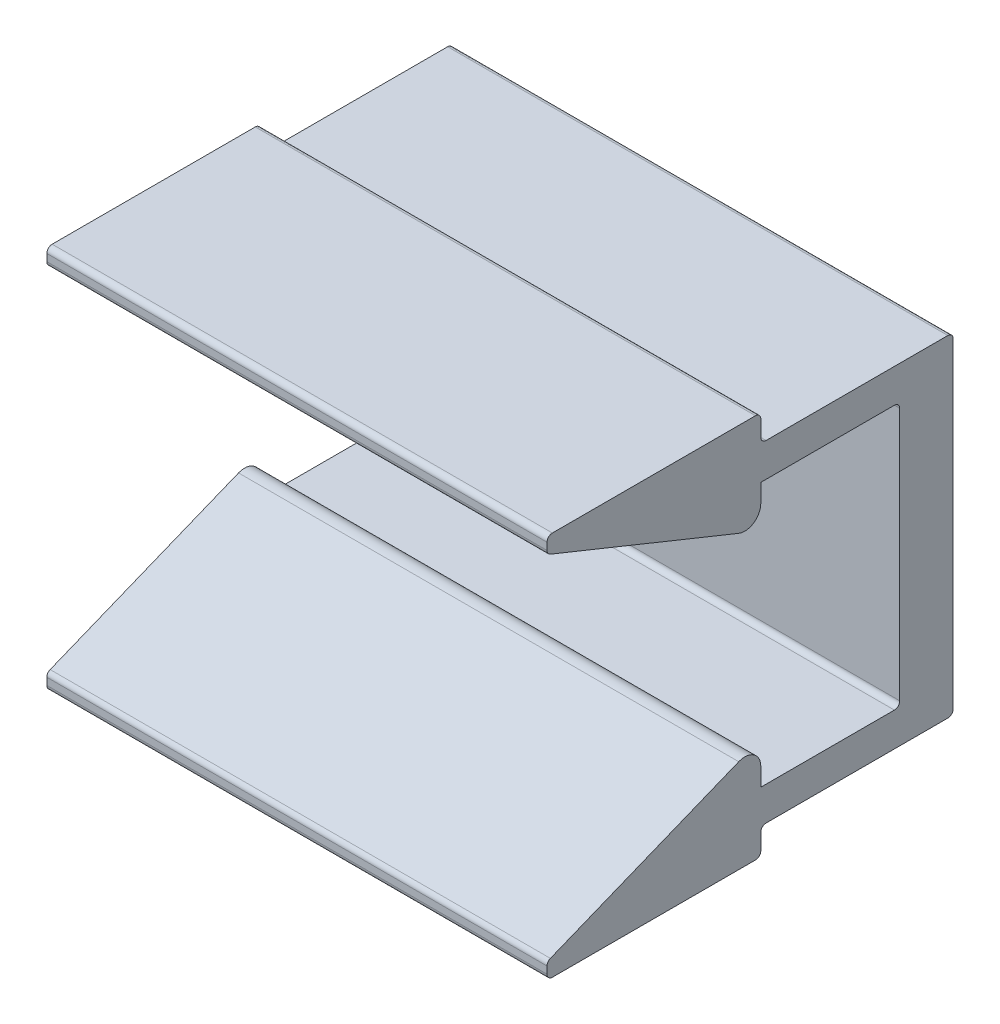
ISO-10303-21;
HEADER;
FILE_DESCRIPTION(('STEP AP214'),'2;1');
FILE_NAME('part.step','',(''),(''),'','','');
FILE_SCHEMA(('AUTOMOTIVE_DESIGN { 1 0 10303 214 1 1 1 1 }'));
ENDSEC;
DATA;
#1=APPLICATION_CONTEXT('core data for automotive mechanical design processes');
#2=APPLICATION_PROTOCOL_DEFINITION('international standard','automotive_design',2000,#1);
#3=PRODUCT_CONTEXT('',#1,'mechanical');
#4=PRODUCT('Part','Part','',(#3));
#5=PRODUCT_RELATED_PRODUCT_CATEGORY('part','',(#4));
#6=PRODUCT_DEFINITION_FORMATION('','',#4);
#7=PRODUCT_DEFINITION_CONTEXT('part definition',#1,'design');
#8=PRODUCT_DEFINITION('design','',#6,#7);
#9=PRODUCT_DEFINITION_SHAPE('','',#8);
#10=(LENGTH_UNIT() NAMED_UNIT(*) SI_UNIT(.MILLI.,.METRE.));
#11=(NAMED_UNIT(*) PLANE_ANGLE_UNIT() SI_UNIT($,.RADIAN.));
#12=(NAMED_UNIT(*) SI_UNIT($,.STERADIAN.) SOLID_ANGLE_UNIT());
#13=UNCERTAINTY_MEASURE_WITH_UNIT(LENGTH_MEASURE(1.E-05),#10,'distance_accuracy_value','');
#14=(GEOMETRIC_REPRESENTATION_CONTEXT(3) GLOBAL_UNCERTAINTY_ASSIGNED_CONTEXT((#13)) GLOBAL_UNIT_ASSIGNED_CONTEXT((#10,
#11,#12)) REPRESENTATION_CONTEXT('',''));
#15=CARTESIAN_POINT('',(0.,0.,0.));
#16=DIRECTION('',(0.,0.,1.));
#17=DIRECTION('',(1.,0.,0.));
#18=AXIS2_PLACEMENT_3D('',#15,#16,#17);
#19=CARTESIAN_POINT('',(5.9436,3.0099,1.27));
#20=DIRECTION('',(0.,0.,-1.));
#21=DIRECTION('',(-1.,0.,0.));
#22=AXIS2_PLACEMENT_3D('',#19,#20,#21);
#23=PLANE('',#22);
#24=DIRECTION('',(0.,-1.,0.));
#25=VECTOR('',#24,1.);
#26=CARTESIAN_POINT('',(-5.9436,3.0099,1.27));
#27=LINE('',#26,#25);
#28=CARTESIAN_POINT('',(-5.9436,3.0099,1.27));
#29=VERTEX_POINT('',#28);
#30=CARTESIAN_POINT('',(-5.9436,-3.0099,1.27));
#31=VERTEX_POINT('',#30);
#32=EDGE_CURVE('E218',#29,#31,#27,.T.);
#33=ORIENTED_EDGE('',*,*,#32,.T.);
#34=DIRECTION('',(-1.,0.,0.));
#35=VECTOR('',#34,1.);
#36=CARTESIAN_POINT('',(5.9436,-3.0099,1.27));
#37=LINE('',#36,#35);
#38=CARTESIAN_POINT('',(5.9436,-3.0099,1.27));
#39=VERTEX_POINT('',#38);
#40=EDGE_CURVE('E426',#39,#31,#37,.T.);
#41=ORIENTED_EDGE('',*,*,#40,.F.);
#42=DIRECTION('',(0.,-1.,0.));
#43=VECTOR('',#42,1.);
#44=CARTESIAN_POINT('',(5.9436,3.0099,1.27));
#45=LINE('',#44,#43);
#46=CARTESIAN_POINT('',(5.9436,3.0099,1.27));
#47=VERTEX_POINT('',#46);
#48=EDGE_CURVE('E293',#47,#39,#45,.T.);
#49=ORIENTED_EDGE('',*,*,#48,.F.);
#50=DIRECTION('',(-1.,0.,0.));
#51=VECTOR('',#50,1.);
#52=CARTESIAN_POINT('',(5.9436,3.0099,1.27));
#53=LINE('',#52,#51);
#54=EDGE_CURVE('E23',#47,#29,#53,.T.);
#55=ORIENTED_EDGE('',*,*,#54,.T.);
#56=EDGE_LOOP('',(#33,#41,#49,#55));
#57=FACE_BOUND('',#56,.T.);
#58=CARTESIAN_POINT('',(0.,0.,1.27));
#59=DIRECTION('',(0.,0.,-1.));
#60=DIRECTION('',(-1.,0.,0.));
#61=AXIS2_PLACEMENT_3D('',#58,#59,#60);
#62=CIRCLE('',#61,1.5875);
#63=CARTESIAN_POINT('',(-1.5875,0.,1.27));
#64=VERTEX_POINT('',#63);
#65=EDGE_CURVE('E230',#64,#64,#62,.F.);
#66=ORIENTED_EDGE('',*,*,#65,.F.);
#67=EDGE_LOOP('',(#66));
#68=FACE_BOUND('',#67,.T.);
#69=ADVANCED_FACE('F14',(#57,#68),#23,.F.);
#70=CARTESIAN_POINT('',(5.9436,-3.81,0.));
#71=DIRECTION('',(0.,0.,1.));
#72=DIRECTION('',(1.,0.,0.));
#73=AXIS2_PLACEMENT_3D('',#70,#71,#72);
#74=PLANE('',#73);
#75=DIRECTION('',(0.,1.,0.));
#76=VECTOR('',#75,1.);
#77=CARTESIAN_POINT('',(-5.9436,-3.81,0.));
#78=LINE('',#77,#76);
#79=CARTESIAN_POINT('',(-5.9436,-3.81,0.));
#80=VERTEX_POINT('',#79);
#81=CARTESIAN_POINT('',(-5.9436,3.81,0.));
#82=VERTEX_POINT('',#81);
#83=EDGE_CURVE('E264',#80,#82,#78,.T.);
#84=ORIENTED_EDGE('',*,*,#83,.T.);
#85=DIRECTION('',(-1.,0.,0.));
#86=VECTOR('',#85,1.);
#87=CARTESIAN_POINT('',(5.9436,3.81,0.));
#88=LINE('',#87,#86);
#89=CARTESIAN_POINT('',(5.9436,3.81,0.));
#90=VERTEX_POINT('',#89);
#91=EDGE_CURVE('E381',#90,#82,#88,.T.);
#92=ORIENTED_EDGE('',*,*,#91,.F.);
#93=DIRECTION('',(0.,1.,0.));
#94=VECTOR('',#93,1.);
#95=CARTESIAN_POINT('',(5.9436,-3.81,0.));
#96=LINE('',#95,#94);
#97=CARTESIAN_POINT('',(5.9436,-3.81,0.));
#98=VERTEX_POINT('',#97);
#99=EDGE_CURVE('E323',#98,#90,#96,.T.);
#100=ORIENTED_EDGE('',*,*,#99,.F.);
#101=DIRECTION('',(-1.,0.,0.));
#102=VECTOR('',#101,1.);
#103=CARTESIAN_POINT('',(5.9436,-3.81,0.));
#104=LINE('',#103,#102);
#105=EDGE_CURVE('E384',#98,#80,#104,.T.);
#106=ORIENTED_EDGE('',*,*,#105,.T.);
#107=EDGE_LOOP('',(#84,#92,#100,#106));
#108=FACE_BOUND('',#107,.T.);
#109=CARTESIAN_POINT('',(0.,0.,0.));
#110=DIRECTION('',(0.,0.,1.));
#111=DIRECTION('',(1.,0.,0.));
#112=AXIS2_PLACEMENT_3D('',#109,#110,#111);
#113=CIRCLE('',#112,1.5875);
#114=CARTESIAN_POINT('',(1.5875,0.,0.));
#115=VERTEX_POINT('',#114);
#116=EDGE_CURVE('E18',#115,#115,#113,.F.);
#117=ORIENTED_EDGE('',*,*,#116,.F.);
#118=EDGE_LOOP('',(#117));
#119=FACE_BOUND('',#118,.T.);
#120=ADVANCED_FACE('F507',(#108,#119),#74,.F.);
#121=CARTESIAN_POINT('',(5.9436,3.1369,4.572));
#122=DIRECTION('',(0.,1.,0.));
#123=DIRECTION('',(0.,0.,1.));
#124=AXIS2_PLACEMENT_3D('',#121,#122,#123);
#125=PLANE('',#124);
#126=DIRECTION('',(0.,0.,-1.));
#127=VECTOR('',#126,1.);
#128=CARTESIAN_POINT('',(-5.9436,3.1369,4.572));
#129=LINE('',#128,#127);
#130=CARTESIAN_POINT('',(-5.9436,3.1369,4.572));
#131=VERTEX_POINT('',#130);
#132=CARTESIAN_POINT('',(-5.9436,3.1369,1.397));
#133=VERTEX_POINT('',#132);
#134=EDGE_CURVE('E216',#131,#133,#129,.T.);
#135=ORIENTED_EDGE('',*,*,#134,.T.);
#136=DIRECTION('',(-1.,0.,0.));
#137=VECTOR('',#136,1.);
#138=CARTESIAN_POINT('',(5.9436,3.1369,1.397));
#139=LINE('',#138,#137);
#140=CARTESIAN_POINT('',(5.9436,3.1369,1.397));
#141=VERTEX_POINT('',#140);
#142=EDGE_CURVE('E9',#141,#133,#139,.T.);
#143=ORIENTED_EDGE('',*,*,#142,.F.);
#144=DIRECTION('',(0.,0.,-1.));
#145=VECTOR('',#144,1.);
#146=CARTESIAN_POINT('',(5.9436,3.1369,4.572));
#147=LINE('',#146,#145);
#148=CARTESIAN_POINT('',(5.9436,3.1369,4.572));
#149=VERTEX_POINT('',#148);
#150=EDGE_CURVE('E290',#149,#141,#147,.T.);
#151=ORIENTED_EDGE('',*,*,#150,.F.);
#152=DIRECTION('',(-1.,0.,0.));
#153=VECTOR('',#152,1.);
#154=CARTESIAN_POINT('',(5.9436,3.1369,4.572));
#155=LINE('',#154,#153);
#156=EDGE_CURVE('E229',#149,#131,#155,.T.);
#157=ORIENTED_EDGE('',*,*,#156,.T.);
#158=EDGE_LOOP('',(#135,#143,#151,#157));
#159=FACE_BOUND('',#158,.T.);
#160=ADVANCED_FACE('F16',(#159),#125,.F.);
#161=CARTESIAN_POINT('',(5.9436,3.0099,1.397));
#162=DIRECTION('',(-1.,0.,0.));
#163=DIRECTION('',(0.,-1.,0.));
#164=AXIS2_PLACEMENT_3D('',#161,#162,#163);
#165=CYLINDRICAL_SURFACE('',#164,0.127);
#166=CARTESIAN_POINT('',(-5.9436,3.0099,1.397));
#167=DIRECTION('',(-1.,0.,0.));
#168=DIRECTION('',(0.,-1.,0.));
#169=AXIS2_PLACEMENT_3D('',#166,#167,#168);
#170=CIRCLE('',#169,0.127);
#171=EDGE_CURVE('E212',#133,#29,#170,.T.);
#172=ORIENTED_EDGE('',*,*,#171,.T.);
#173=ORIENTED_EDGE('',*,*,#54,.F.);
#174=CARTESIAN_POINT('',(5.9436,3.0099,1.397));
#175=DIRECTION('',(-1.,0.,0.));
#176=DIRECTION('',(0.,-1.,0.));
#177=AXIS2_PLACEMENT_3D('',#174,#175,#176);
#178=CIRCLE('',#177,0.127);
#179=EDGE_CURVE('E225',#141,#47,#178,.T.);
#180=ORIENTED_EDGE('',*,*,#179,.F.);
#181=ORIENTED_EDGE('',*,*,#142,.T.);
#182=EDGE_LOOP('',(#172,#173,#180,#181));
#183=FACE_BOUND('',#182,.T.);
#184=ADVANCED_FACE('F224',(#183),#165,.F.);
#185=CARTESIAN_POINT('',(5.9436,-3.0099,1.397));
#186=DIRECTION('',(-1.,0.,0.));
#187=DIRECTION('',(0.,-1.,0.));
#188=AXIS2_PLACEMENT_3D('',#185,#186,#187);
#189=CYLINDRICAL_SURFACE('',#188,0.127);
#190=CARTESIAN_POINT('',(-5.9436,-3.0099,1.397));
#191=DIRECTION('',(-1.,0.,0.));
#192=DIRECTION('',(0.,1.,0.));
#193=AXIS2_PLACEMENT_3D('',#190,#191,#192);
#194=CIRCLE('',#193,0.127);
#195=CARTESIAN_POINT('',(-5.9436,-3.1369,1.397));
#196=VERTEX_POINT('',#195);
#197=EDGE_CURVE('E236',#31,#196,#194,.T.);
#198=ORIENTED_EDGE('',*,*,#197,.T.);
#199=DIRECTION('',(-1.,0.,0.));
#200=VECTOR('',#199,1.);
#201=CARTESIAN_POINT('',(5.9436,-3.1369,1.397));
#202=LINE('',#201,#200);
#203=CARTESIAN_POINT('',(5.9436,-3.1369,1.397));
#204=VERTEX_POINT('',#203);
#205=EDGE_CURVE('E423',#204,#196,#202,.T.);
#206=ORIENTED_EDGE('',*,*,#205,.F.);
#207=CARTESIAN_POINT('',(5.9436,-3.0099,1.397));
#208=DIRECTION('',(-1.,0.,0.));
#209=DIRECTION('',(0.,1.,0.));
#210=AXIS2_PLACEMENT_3D('',#207,#208,#209);
#211=CIRCLE('',#210,0.127);
#212=EDGE_CURVE('E295',#39,#204,#211,.T.);
#213=ORIENTED_EDGE('',*,*,#212,.F.);
#214=ORIENTED_EDGE('',*,*,#40,.T.);
#215=EDGE_LOOP('',(#198,#206,#213,#214));
#216=FACE_BOUND('',#215,.T.);
#217=ADVANCED_FACE('F439',(#216),#189,.F.);
#218=CARTESIAN_POINT('',(5.9436,-3.1369,4.572));
#219=DIRECTION('',(0.,-1.,0.));
#220=DIRECTION('',(0.,0.,-1.));
#221=AXIS2_PLACEMENT_3D('',#218,#219,#220);
#222=PLANE('',#221);
#223=DIRECTION('',(0.,0.,1.));
#224=VECTOR('',#223,1.);
#225=CARTESIAN_POINT('',(-5.9436,-3.1369,4.572));
#226=LINE('',#225,#224);
#227=CARTESIAN_POINT('',(-5.9436,-3.1369,4.572));
#228=VERTEX_POINT('',#227);
#229=EDGE_CURVE('E238',#196,#228,#226,.T.);
#230=ORIENTED_EDGE('',*,*,#229,.T.);
#231=DIRECTION('',(-1.,0.,0.));
#232=VECTOR('',#231,1.);
#233=CARTESIAN_POINT('',(5.9436,-3.1369,4.572));
#234=LINE('',#233,#232);
#235=CARTESIAN_POINT('',(5.9436,-3.1369,4.572));
#236=VERTEX_POINT('',#235);
#237=EDGE_CURVE('E420',#236,#228,#234,.T.);
#238=ORIENTED_EDGE('',*,*,#237,.F.);
#239=DIRECTION('',(0.,0.,1.));
#240=VECTOR('',#239,1.);
#241=CARTESIAN_POINT('',(5.9436,-3.1369,4.572));
#242=LINE('',#241,#240);
#243=EDGE_CURVE('E297',#204,#236,#242,.T.);
#244=ORIENTED_EDGE('',*,*,#243,.F.);
#245=ORIENTED_EDGE('',*,*,#205,.T.);
#246=EDGE_LOOP('',(#230,#238,#244,#245));
#247=FACE_BOUND('',#246,.T.);
#248=ADVANCED_FACE('F442',(#247),#222,.F.);
#249=CARTESIAN_POINT('',(5.9436,-2.70340250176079,4.572));
#250=DIRECTION('',(0.,0.,1.));
#251=DIRECTION('',(0.,-1.,0.));
#252=AXIS2_PLACEMENT_3D('',#249,#250,#251);
#253=PLANE('',#252);
#254=DIRECTION('',(0.,1.,0.));
#255=VECTOR('',#254,1.);
#256=CARTESIAN_POINT('',(-5.9436,-2.70340250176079,4.572));
#257=LINE('',#256,#255);
#258=CARTESIAN_POINT('',(-5.9436,-2.70340250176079,4.572));
#259=VERTEX_POINT('',#258);
#260=EDGE_CURVE('E240',#228,#259,#257,.T.);
#261=ORIENTED_EDGE('',*,*,#260,.T.);
#262=DIRECTION('',(-1.,0.,0.));
#263=VECTOR('',#262,1.);
#264=CARTESIAN_POINT('',(5.9436,-2.70340250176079,4.572));
#265=LINE('',#264,#263);
#266=CARTESIAN_POINT('',(5.9436,-2.70340250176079,4.572));
#267=VERTEX_POINT('',#266);
#268=EDGE_CURVE('E417',#267,#259,#265,.T.);
#269=ORIENTED_EDGE('',*,*,#268,.F.);
#270=DIRECTION('',(0.,1.,0.));
#271=VECTOR('',#270,1.);
#272=CARTESIAN_POINT('',(5.9436,-2.70340250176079,4.572));
#273=LINE('',#272,#271);
#274=EDGE_CURVE('E299',#236,#267,#273,.T.);
#275=ORIENTED_EDGE('',*,*,#274,.F.);
#276=ORIENTED_EDGE('',*,*,#237,.T.);
#277=EDGE_LOOP('',(#261,#269,#275,#276));
#278=FACE_BOUND('',#277,.T.);
#279=ADVANCED_FACE('F447',(#278),#253,.F.);
#280=CARTESIAN_POINT('',(5.9436,-2.70340250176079,4.953));
#281=DIRECTION('',(-1.,0.,0.));
#282=DIRECTION('',(0.,-1.,0.));
#283=AXIS2_PLACEMENT_3D('',#280,#281,#282);
#284=CYLINDRICAL_SURFACE('',#283,0.381);
#285=CARTESIAN_POINT('',(-5.9436,-2.70340250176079,4.953));
#286=DIRECTION('',(1.,0.,0.));
#287=DIRECTION('',(0.,-1.,0.));
#288=AXIS2_PLACEMENT_3D('',#285,#286,#287);
#289=CIRCLE('',#288,0.381);
#290=CARTESIAN_POINT('',(-5.9436,-2.35014545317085,5.09572511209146));
#291=VERTEX_POINT('',#290);
#292=EDGE_CURVE('E242',#259,#291,#289,.T.);
#293=ORIENTED_EDGE('',*,*,#292,.T.);
#294=DIRECTION('',(-1.,0.,0.));
#295=VECTOR('',#294,1.);
#296=CARTESIAN_POINT('',(5.9436,-2.35014545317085,5.09572511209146));
#297=LINE('',#296,#295);
#298=CARTESIAN_POINT('',(5.9436,-2.35014545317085,5.09572511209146));
#299=VERTEX_POINT('',#298);
#300=EDGE_CURVE('E414',#299,#291,#297,.T.);
#301=ORIENTED_EDGE('',*,*,#300,.F.);
#302=CARTESIAN_POINT('',(5.9436,-2.70340250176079,4.953));
#303=DIRECTION('',(1.,0.,0.));
#304=DIRECTION('',(0.,-1.,0.));
#305=AXIS2_PLACEMENT_3D('',#302,#303,#304);
#306=CIRCLE('',#305,0.381);
#307=EDGE_CURVE('E301',#267,#299,#306,.T.);
#308=ORIENTED_EDGE('',*,*,#307,.F.);
#309=ORIENTED_EDGE('',*,*,#268,.T.);
#310=EDGE_LOOP('',(#293,#301,#308,#309));
#311=FACE_BOUND('',#310,.T.);
#312=ADVANCED_FACE('F453',(#311),#284,.T.);
#313=CARTESIAN_POINT('',(5.9436,-4.15891023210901,9.57257503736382));
#314=DIRECTION('',(0.,-0.92718385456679,-0.374606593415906));
#315=DIRECTION('',(0.,0.374606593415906,-0.92718385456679));
#316=AXIS2_PLACEMENT_3D('',#313,#314,#315);
#317=PLANE('',#316);
#318=DIRECTION('',(0.,-0.374606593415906,0.92718385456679));
#319=VECTOR('',#318,1.);
#320=CARTESIAN_POINT('',(-5.9436,-4.15891023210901,9.57257503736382));
#321=LINE('',#320,#319);
#322=CARTESIAN_POINT('',(-5.9436,-4.158910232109,9.57257503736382));
#323=VERTEX_POINT('',#322);
#324=EDGE_CURVE('E244',#291,#323,#321,.T.);
#325=ORIENTED_EDGE('',*,*,#324,.T.);
#326=DIRECTION('',(-1.,0.,0.));
#327=VECTOR('',#326,1.);
#328=CARTESIAN_POINT('',(5.9436,-4.158910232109,9.57257503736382));
#329=LINE('',#328,#327);
#330=CARTESIAN_POINT('',(5.9436,-4.158910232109,9.57257503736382));
#331=VERTEX_POINT('',#330);
#332=EDGE_CURVE('E411',#331,#323,#329,.T.);
#333=ORIENTED_EDGE('',*,*,#332,.F.);
#334=DIRECTION('',(0.,-0.374606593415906,0.92718385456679));
#335=VECTOR('',#334,1.);
#336=CARTESIAN_POINT('',(5.9436,-4.15891023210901,9.57257503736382));
#337=LINE('',#336,#335);
#338=EDGE_CURVE('E303',#299,#331,#337,.T.);
#339=ORIENTED_EDGE('',*,*,#338,.F.);
#340=ORIENTED_EDGE('',*,*,#300,.T.);
#341=EDGE_LOOP('',(#325,#333,#339,#340));
#342=FACE_BOUND('',#341,.T.);
#343=ADVANCED_FACE('F457',(#342),#317,.F.);
#344=CARTESIAN_POINT('',(5.9436,-4.27666258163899,9.525));
#345=DIRECTION('',(-1.,0.,0.));
#346=DIRECTION('',(0.,-1.,0.));
#347=AXIS2_PLACEMENT_3D('',#344,#345,#346);
#348=CYLINDRICAL_SURFACE('',#347,0.127);
#349=CARTESIAN_POINT('',(-5.9436,-4.27666258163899,9.525));
#350=DIRECTION('',(1.,0.,0.));
#351=DIRECTION('',(0.,-1.,0.));
#352=AXIS2_PLACEMENT_3D('',#349,#350,#351);
#353=CIRCLE('',#352,0.127);
#354=CARTESIAN_POINT('',(-5.9436,-4.27666258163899,9.652));
#355=VERTEX_POINT('',#354);
#356=EDGE_CURVE('E246',#323,#355,#353,.T.);
#357=ORIENTED_EDGE('',*,*,#356,.T.);
#358=DIRECTION('',(-1.,0.,0.));
#359=VECTOR('',#358,1.);
#360=CARTESIAN_POINT('',(5.9436,-4.27666258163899,9.652));
#361=LINE('',#360,#359);
#362=CARTESIAN_POINT('',(5.9436,-4.27666258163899,9.652));
#363=VERTEX_POINT('',#362);
#364=EDGE_CURVE('E408',#363,#355,#361,.T.);
#365=ORIENTED_EDGE('',*,*,#364,.F.);
#366=CARTESIAN_POINT('',(5.9436,-4.27666258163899,9.525));
#367=DIRECTION('',(1.,0.,0.));
#368=DIRECTION('',(0.,-1.,0.));
#369=AXIS2_PLACEMENT_3D('',#366,#367,#368);
#370=CIRCLE('',#369,0.127);
#371=EDGE_CURVE('E305',#331,#363,#370,.T.);
#372=ORIENTED_EDGE('',*,*,#371,.F.);
#373=ORIENTED_EDGE('',*,*,#332,.T.);
#374=EDGE_LOOP('',(#357,#365,#372,#373));
#375=FACE_BOUND('',#374,.T.);
#376=ADVANCED_FACE('F462',(#375),#348,.T.);
#377=CARTESIAN_POINT('',(5.9436,-4.445,9.652));
#378=DIRECTION('',(0.,0.,-1.));
#379=DIRECTION('',(0.,1.,0.));
#380=AXIS2_PLACEMENT_3D('',#377,#378,#379);
#381=PLANE('',#380);
#382=DIRECTION('',(0.,-1.,0.));
#383=VECTOR('',#382,1.);
#384=CARTESIAN_POINT('',(-5.9436,-4.445,9.652));
#385=LINE('',#384,#383);
#386=CARTESIAN_POINT('',(-5.9436,-4.445,9.652));
#387=VERTEX_POINT('',#386);
#388=EDGE_CURVE('E248',#355,#387,#385,.T.);
#389=ORIENTED_EDGE('',*,*,#388,.T.);
#390=DIRECTION('',(-1.,0.,0.));
#391=VECTOR('',#390,1.);
#392=CARTESIAN_POINT('',(5.9436,-4.445,9.652));
#393=LINE('',#392,#391);
#394=CARTESIAN_POINT('',(5.9436,-4.445,9.652));
#395=VERTEX_POINT('',#394);
#396=EDGE_CURVE('E405',#395,#387,#393,.T.);
#397=ORIENTED_EDGE('',*,*,#396,.F.);
#398=DIRECTION('',(0.,-1.,0.));
#399=VECTOR('',#398,1.);
#400=CARTESIAN_POINT('',(5.9436,-4.445,9.652));
#401=LINE('',#400,#399);
#402=EDGE_CURVE('E307',#363,#395,#401,.T.);
#403=ORIENTED_EDGE('',*,*,#402,.F.);
#404=ORIENTED_EDGE('',*,*,#364,.T.);
#405=EDGE_LOOP('',(#389,#397,#403,#404));
#406=FACE_BOUND('',#405,.T.);
#407=ADVANCED_FACE('F468',(#406),#381,.F.);
#408=CARTESIAN_POINT('',(5.9436,-4.445,9.525));
#409=DIRECTION('',(-1.,0.,0.));
#410=DIRECTION('',(0.,-1.,0.));
#411=AXIS2_PLACEMENT_3D('',#408,#409,#410);
#412=CYLINDRICAL_SURFACE('',#411,0.127);
#413=CARTESIAN_POINT('',(-5.9436,-4.445,9.525));
#414=DIRECTION('',(1.,0.,0.));
#415=DIRECTION('',(0.,-1.,0.));
#416=AXIS2_PLACEMENT_3D('',#413,#414,#415);
#417=CIRCLE('',#416,0.127);
#418=CARTESIAN_POINT('',(-5.9436,-4.572,9.525));
#419=VERTEX_POINT('',#418);
#420=EDGE_CURVE('E250',#387,#419,#417,.T.);
#421=ORIENTED_EDGE('',*,*,#420,.T.);
#422=DIRECTION('',(-1.,0.,0.));
#423=VECTOR('',#422,1.);
#424=CARTESIAN_POINT('',(5.9436,-4.572,9.525));
#425=LINE('',#424,#423);
#426=CARTESIAN_POINT('',(5.9436,-4.572,9.525));
#427=VERTEX_POINT('',#426);
#428=EDGE_CURVE('E402',#427,#419,#425,.T.);
#429=ORIENTED_EDGE('',*,*,#428,.F.);
#430=CARTESIAN_POINT('',(5.9436,-4.445,9.525));
#431=DIRECTION('',(1.,0.,0.));
#432=DIRECTION('',(0.,-1.,0.));
#433=AXIS2_PLACEMENT_3D('',#430,#431,#432);
#434=CIRCLE('',#433,0.127);
#435=EDGE_CURVE('E309',#395,#427,#434,.T.);
#436=ORIENTED_EDGE('',*,*,#435,.F.);
#437=ORIENTED_EDGE('',*,*,#396,.T.);
#438=EDGE_LOOP('',(#421,#429,#436,#437));
#439=FACE_BOUND('',#438,.T.);
#440=ADVANCED_FACE('F472',(#439),#412,.T.);
#441=CARTESIAN_POINT('',(5.9436,-4.572,4.699));
#442=DIRECTION('',(0.,1.,0.));
#443=DIRECTION('',(0.,0.,1.));
#444=AXIS2_PLACEMENT_3D('',#441,#442,#443);
#445=PLANE('',#444);
#446=DIRECTION('',(0.,0.,-1.));
#447=VECTOR('',#446,1.);
#448=CARTESIAN_POINT('',(-5.9436,-4.572,4.699));
#449=LINE('',#448,#447);
#450=CARTESIAN_POINT('',(-5.9436,-4.572,4.699));
#451=VERTEX_POINT('',#450);
#452=EDGE_CURVE('E252',#419,#451,#449,.T.);
#453=ORIENTED_EDGE('',*,*,#452,.T.);
#454=DIRECTION('',(-1.,0.,0.));
#455=VECTOR('',#454,1.);
#456=CARTESIAN_POINT('',(5.9436,-4.572,4.699));
#457=LINE('',#456,#455);
#458=CARTESIAN_POINT('',(5.9436,-4.572,4.699));
#459=VERTEX_POINT('',#458);
#460=EDGE_CURVE('E399',#459,#451,#457,.T.);
#461=ORIENTED_EDGE('',*,*,#460,.F.);
#462=DIRECTION('',(0.,0.,-1.));
#463=VECTOR('',#462,1.);
#464=CARTESIAN_POINT('',(5.9436,-4.572,4.699));
#465=LINE('',#464,#463);
#466=EDGE_CURVE('E311',#427,#459,#465,.T.);
#467=ORIENTED_EDGE('',*,*,#466,.F.);
#468=ORIENTED_EDGE('',*,*,#428,.T.);
#469=EDGE_LOOP('',(#453,#461,#467,#468));
#470=FACE_BOUND('',#469,.T.);
#471=ADVANCED_FACE('F477',(#470),#445,.F.);
#472=CARTESIAN_POINT('',(5.9436,-4.445,4.699));
#473=DIRECTION('',(-1.,0.,0.));
#474=DIRECTION('',(0.,-1.,0.));
#475=AXIS2_PLACEMENT_3D('',#472,#473,#474);
#476=CYLINDRICAL_SURFACE('',#475,0.127);
#477=CARTESIAN_POINT('',(-5.9436,-4.445,4.699));
#478=DIRECTION('',(1.,0.,0.));
#479=DIRECTION('',(0.,-1.,0.));
#480=AXIS2_PLACEMENT_3D('',#477,#478,#479);
#481=CIRCLE('',#480,0.127);
#482=CARTESIAN_POINT('',(-5.9436,-4.445,4.572));
#483=VERTEX_POINT('',#482);
#484=EDGE_CURVE('E254',#451,#483,#481,.T.);
#485=ORIENTED_EDGE('',*,*,#484,.T.);
#486=DIRECTION('',(-1.,0.,0.));
#487=VECTOR('',#486,1.);
#488=CARTESIAN_POINT('',(5.9436,-4.445,4.572));
#489=LINE('',#488,#487);
#490=CARTESIAN_POINT('',(5.9436,-4.445,4.572));
#491=VERTEX_POINT('',#490);
#492=EDGE_CURVE('E396',#491,#483,#489,.T.);
#493=ORIENTED_EDGE('',*,*,#492,.F.);
#494=CARTESIAN_POINT('',(5.9436,-4.445,4.699));
#495=DIRECTION('',(1.,0.,0.));
#496=DIRECTION('',(0.,-1.,0.));
#497=AXIS2_PLACEMENT_3D('',#494,#495,#496);
#498=CIRCLE('',#497,0.127);
#499=EDGE_CURVE('E313',#459,#491,#498,.T.);
#500=ORIENTED_EDGE('',*,*,#499,.F.);
#501=ORIENTED_EDGE('',*,*,#460,.T.);
#502=EDGE_LOOP('',(#485,#493,#500,#501));
#503=FACE_BOUND('',#502,.T.);
#504=ADVANCED_FACE('F483',(#503),#476,.T.);
#505=CARTESIAN_POINT('',(5.9436,-4.064,4.572));
#506=DIRECTION('',(0.,0.,1.));
#507=DIRECTION('',(1.,0.,0.));
#508=AXIS2_PLACEMENT_3D('',#505,#506,#507);
#509=PLANE('',#508);
#510=DIRECTION('',(0.,1.,0.));
#511=VECTOR('',#510,1.);
#512=CARTESIAN_POINT('',(-5.9436,-4.064,4.572));
#513=LINE('',#512,#511);
#514=CARTESIAN_POINT('',(-5.9436,-4.064,4.572));
#515=VERTEX_POINT('',#514);
#516=EDGE_CURVE('E256',#483,#515,#513,.T.);
#517=ORIENTED_EDGE('',*,*,#516,.T.);
#518=DIRECTION('',(-1.,0.,0.));
#519=VECTOR('',#518,1.);
#520=CARTESIAN_POINT('',(5.9436,-4.064,4.572));
#521=LINE('',#520,#519);
#522=CARTESIAN_POINT('',(5.9436,-4.064,4.572));
#523=VERTEX_POINT('',#522);
#524=EDGE_CURVE('E393',#523,#515,#521,.T.);
#525=ORIENTED_EDGE('',*,*,#524,.F.);
#526=DIRECTION('',(0.,1.,0.));
#527=VECTOR('',#526,1.);
#528=CARTESIAN_POINT('',(5.9436,-4.064,4.572));
#529=LINE('',#528,#527);
#530=EDGE_CURVE('E315',#491,#523,#529,.T.);
#531=ORIENTED_EDGE('',*,*,#530,.F.);
#532=ORIENTED_EDGE('',*,*,#492,.T.);
#533=EDGE_LOOP('',(#517,#525,#531,#532));
#534=FACE_BOUND('',#533,.T.);
#535=ADVANCED_FACE('F487',(#534),#509,.F.);
#536=CARTESIAN_POINT('',(5.9436,-4.064,4.445));
#537=DIRECTION('',(-1.,0.,0.));
#538=DIRECTION('',(0.,-1.,0.));
#539=AXIS2_PLACEMENT_3D('',#536,#537,#538);
#540=CYLINDRICAL_SURFACE('',#539,0.127);
#541=CARTESIAN_POINT('',(-5.9436,-4.064,4.445));
#542=DIRECTION('',(-1.,0.,0.));
#543=DIRECTION('',(0.,1.,0.));
#544=AXIS2_PLACEMENT_3D('',#541,#542,#543);
#545=CIRCLE('',#544,0.127);
#546=CARTESIAN_POINT('',(-5.9436,-3.937,4.445));
#547=VERTEX_POINT('',#546);
#548=EDGE_CURVE('E258',#515,#547,#545,.T.);
#549=ORIENTED_EDGE('',*,*,#548,.T.);
#550=DIRECTION('',(-1.,0.,0.));
#551=VECTOR('',#550,1.);
#552=CARTESIAN_POINT('',(5.9436,-3.937,4.445));
#553=LINE('',#552,#551);
#554=CARTESIAN_POINT('',(5.9436,-3.937,4.445));
#555=VERTEX_POINT('',#554);
#556=EDGE_CURVE('E390',#555,#547,#553,.T.);
#557=ORIENTED_EDGE('',*,*,#556,.F.);
#558=CARTESIAN_POINT('',(5.9436,-4.064,4.445));
#559=DIRECTION('',(-1.,0.,0.));
#560=DIRECTION('',(0.,1.,0.));
#561=AXIS2_PLACEMENT_3D('',#558,#559,#560);
#562=CIRCLE('',#561,0.127);
#563=EDGE_CURVE('E317',#523,#555,#562,.T.);
#564=ORIENTED_EDGE('',*,*,#563,.F.);
#565=ORIENTED_EDGE('',*,*,#524,.T.);
#566=EDGE_LOOP('',(#549,#557,#564,#565));
#567=FACE_BOUND('',#566,.T.);
#568=ADVANCED_FACE('F492',(#567),#540,.F.);
#569=CARTESIAN_POINT('',(5.9436,-3.937,0.127));
#570=DIRECTION('',(0.,1.,0.));
#571=DIRECTION('',(-1.,0.,0.));
#572=AXIS2_PLACEMENT_3D('',#569,#570,#571);
#573=PLANE('',#572);
#574=DIRECTION('',(0.,0.,-1.));
#575=VECTOR('',#574,1.);
#576=CARTESIAN_POINT('',(-5.9436,-3.937,0.127));
#577=LINE('',#576,#575);
#578=CARTESIAN_POINT('',(-5.9436,-3.937,0.127));
#579=VERTEX_POINT('',#578);
#580=EDGE_CURVE('E260',#547,#579,#577,.T.);
#581=ORIENTED_EDGE('',*,*,#580,.T.);
#582=DIRECTION('',(-1.,0.,0.));
#583=VECTOR('',#582,1.);
#584=CARTESIAN_POINT('',(5.9436,-3.937,0.127));
#585=LINE('',#584,#583);
#586=CARTESIAN_POINT('',(5.9436,-3.937,0.127));
#587=VERTEX_POINT('',#586);
#588=EDGE_CURVE('E387',#587,#579,#585,.T.);
#589=ORIENTED_EDGE('',*,*,#588,.F.);
#590=DIRECTION('',(0.,0.,-1.));
#591=VECTOR('',#590,1.);
#592=CARTESIAN_POINT('',(5.9436,-3.937,0.127));
#593=LINE('',#592,#591);
#594=EDGE_CURVE('E319',#555,#587,#593,.T.);
#595=ORIENTED_EDGE('',*,*,#594,.F.);
#596=ORIENTED_EDGE('',*,*,#556,.T.);
#597=EDGE_LOOP('',(#581,#589,#595,#596));
#598=FACE_BOUND('',#597,.T.);
#599=ADVANCED_FACE('F498',(#598),#573,.F.);
#600=CARTESIAN_POINT('',(5.9436,-3.81,0.127));
#601=DIRECTION('',(-1.,0.,0.));
#602=DIRECTION('',(0.,-1.,0.));
#603=AXIS2_PLACEMENT_3D('',#600,#601,#602);
#604=CYLINDRICAL_SURFACE('',#603,0.127);
#605=CARTESIAN_POINT('',(-5.9436,-3.81,0.127));
#606=DIRECTION('',(1.,0.,0.));
#607=DIRECTION('',(0.,-1.,0.));
#608=AXIS2_PLACEMENT_3D('',#605,#606,#607);
#609=CIRCLE('',#608,0.127);
#610=EDGE_CURVE('E262',#579,#80,#609,.T.);
#611=ORIENTED_EDGE('',*,*,#610,.T.);
#612=ORIENTED_EDGE('',*,*,#105,.F.);
#613=CARTESIAN_POINT('',(5.9436,-3.81,0.127));
#614=DIRECTION('',(1.,0.,0.));
#615=DIRECTION('',(0.,-1.,0.));
#616=AXIS2_PLACEMENT_3D('',#613,#614,#615);
#617=CIRCLE('',#616,0.127);
#618=EDGE_CURVE('E321',#587,#98,#617,.T.);
#619=ORIENTED_EDGE('',*,*,#618,.F.);
#620=ORIENTED_EDGE('',*,*,#588,.T.);
#621=EDGE_LOOP('',(#611,#612,#619,#620));
#622=FACE_BOUND('',#621,.T.);
#623=ADVANCED_FACE('F502',(#622),#604,.T.);
#624=CARTESIAN_POINT('',(5.9436,3.81,0.127));
#625=DIRECTION('',(-1.,0.,0.));
#626=DIRECTION('',(0.,-1.,0.));
#627=AXIS2_PLACEMENT_3D('',#624,#625,#626);
#628=CYLINDRICAL_SURFACE('',#627,0.127);
#629=CARTESIAN_POINT('',(-5.9436,3.81,0.127));
#630=DIRECTION('',(1.,0.,0.));
#631=DIRECTION('',(0.,1.,0.));
#632=AXIS2_PLACEMENT_3D('',#629,#630,#631);
#633=CIRCLE('',#632,0.127);
#634=CARTESIAN_POINT('',(-5.9436,3.937,0.127));
#635=VERTEX_POINT('',#634);
#636=EDGE_CURVE('E266',#82,#635,#633,.T.);
#637=ORIENTED_EDGE('',*,*,#636,.T.);
#638=DIRECTION('',(-1.,0.,0.));
#639=VECTOR('',#638,1.);
#640=CARTESIAN_POINT('',(5.9436,3.937,0.127));
#641=LINE('',#640,#639);
#642=CARTESIAN_POINT('',(5.9436,3.937,0.127));
#643=VERTEX_POINT('',#642);
#644=EDGE_CURVE('E378',#643,#635,#641,.T.);
#645=ORIENTED_EDGE('',*,*,#644,.F.);
#646=CARTESIAN_POINT('',(5.9436,3.81,0.127));
#647=DIRECTION('',(1.,0.,0.));
#648=DIRECTION('',(0.,1.,0.));
#649=AXIS2_PLACEMENT_3D('',#646,#647,#648);
#650=CIRCLE('',#649,0.127);
#651=EDGE_CURVE('E325',#90,#643,#650,.T.);
#652=ORIENTED_EDGE('',*,*,#651,.F.);
#653=ORIENTED_EDGE('',*,*,#91,.T.);
#654=EDGE_LOOP('',(#637,#645,#652,#653));
#655=FACE_BOUND('',#654,.T.);
#656=ADVANCED_FACE('F514',(#655),#628,.T.);
#657=CARTESIAN_POINT('',(5.9436,3.937,0.127));
#658=DIRECTION('',(0.,-1.,0.));
#659=DIRECTION('',(1.,0.,0.));
#660=AXIS2_PLACEMENT_3D('',#657,#658,#659);
#661=PLANE('',#660);
#662=DIRECTION('',(0.,0.,1.));
#663=VECTOR('',#662,1.);
#664=CARTESIAN_POINT('',(-5.9436,3.937,0.127));
#665=LINE('',#664,#663);
#666=CARTESIAN_POINT('',(-5.9436,3.937,4.445));
#667=VERTEX_POINT('',#666);
#668=EDGE_CURVE('E268',#635,#667,#665,.T.);
#669=ORIENTED_EDGE('',*,*,#668,.T.);
#670=DIRECTION('',(-1.,0.,0.));
#671=VECTOR('',#670,1.);
#672=CARTESIAN_POINT('',(5.9436,3.937,4.445));
#673=LINE('',#672,#671);
#674=CARTESIAN_POINT('',(5.9436,3.937,4.445));
#675=VERTEX_POINT('',#674);
#676=EDGE_CURVE('E375',#675,#667,#673,.T.);
#677=ORIENTED_EDGE('',*,*,#676,.F.);
#678=DIRECTION('',(0.,0.,1.));
#679=VECTOR('',#678,1.);
#680=CARTESIAN_POINT('',(5.9436,3.937,0.127));
#681=LINE('',#680,#679);
#682=EDGE_CURVE('E327',#643,#675,#681,.T.);
#683=ORIENTED_EDGE('',*,*,#682,.F.);
#684=ORIENTED_EDGE('',*,*,#644,.T.);
#685=EDGE_LOOP('',(#669,#677,#683,#684));
#686=FACE_BOUND('',#685,.T.);
#687=ADVANCED_FACE('F518',(#686),#661,.F.);
#688=CARTESIAN_POINT('',(5.9436,4.064,4.445));
#689=DIRECTION('',(-1.,0.,0.));
#690=DIRECTION('',(0.,-1.,0.));
#691=AXIS2_PLACEMENT_3D('',#688,#689,#690);
#692=CYLINDRICAL_SURFACE('',#691,0.127);
#693=CARTESIAN_POINT('',(-5.9436,4.064,4.445));
#694=DIRECTION('',(-1.,0.,0.));
#695=DIRECTION('',(0.,-1.,0.));
#696=AXIS2_PLACEMENT_3D('',#693,#694,#695);
#697=CIRCLE('',#696,0.127);
#698=CARTESIAN_POINT('',(-5.9436,4.064,4.572));
#699=VERTEX_POINT('',#698);
#700=EDGE_CURVE('E270',#667,#699,#697,.T.);
#701=ORIENTED_EDGE('',*,*,#700,.T.);
#702=DIRECTION('',(-1.,0.,0.));
#703=VECTOR('',#702,1.);
#704=CARTESIAN_POINT('',(5.9436,4.064,4.572));
#705=LINE('',#704,#703);
#706=CARTESIAN_POINT('',(5.9436,4.064,4.572));
#707=VERTEX_POINT('',#706);
#708=EDGE_CURVE('E372',#707,#699,#705,.T.);
#709=ORIENTED_EDGE('',*,*,#708,.F.);
#710=CARTESIAN_POINT('',(5.9436,4.064,4.445));
#711=DIRECTION('',(-1.,0.,0.));
#712=DIRECTION('',(0.,-1.,0.));
#713=AXIS2_PLACEMENT_3D('',#710,#711,#712);
#714=CIRCLE('',#713,0.127);
#715=EDGE_CURVE('E329',#675,#707,#714,.T.);
#716=ORIENTED_EDGE('',*,*,#715,.F.);
#717=ORIENTED_EDGE('',*,*,#676,.T.);
#718=EDGE_LOOP('',(#701,#709,#716,#717));
#719=FACE_BOUND('',#718,.T.);
#720=ADVANCED_FACE('F523',(#719),#692,.F.);
#721=CARTESIAN_POINT('',(5.9436,4.064,4.572));
#722=DIRECTION('',(0.,0.,1.));
#723=DIRECTION('',(1.,0.,0.));
#724=AXIS2_PLACEMENT_3D('',#721,#722,#723);
#725=PLANE('',#724);
#726=DIRECTION('',(0.,1.,0.));
#727=VECTOR('',#726,1.);
#728=CARTESIAN_POINT('',(-5.9436,4.064,4.572));
#729=LINE('',#728,#727);
#730=CARTESIAN_POINT('',(-5.9436,4.445,4.572));
#731=VERTEX_POINT('',#730);
#732=EDGE_CURVE('E272',#699,#731,#729,.T.);
#733=ORIENTED_EDGE('',*,*,#732,.T.);
#734=DIRECTION('',(-1.,0.,0.));
#735=VECTOR('',#734,1.);
#736=CARTESIAN_POINT('',(5.9436,4.445,4.572));
#737=LINE('',#736,#735);
#738=CARTESIAN_POINT('',(5.9436,4.445,4.572));
#739=VERTEX_POINT('',#738);
#740=EDGE_CURVE('E369',#739,#731,#737,.T.);
#741=ORIENTED_EDGE('',*,*,#740,.F.);
#742=DIRECTION('',(0.,1.,0.));
#743=VECTOR('',#742,1.);
#744=CARTESIAN_POINT('',(5.9436,4.064,4.572));
#745=LINE('',#744,#743);
#746=EDGE_CURVE('E331',#707,#739,#745,.T.);
#747=ORIENTED_EDGE('',*,*,#746,.F.);
#748=ORIENTED_EDGE('',*,*,#708,.T.);
#749=EDGE_LOOP('',(#733,#741,#747,#748));
#750=FACE_BOUND('',#749,.T.);
#751=ADVANCED_FACE('F529',(#750),#725,.F.);
#752=CARTESIAN_POINT('',(5.9436,4.445,4.699));
#753=DIRECTION('',(-1.,0.,0.));
#754=DIRECTION('',(0.,-1.,0.));
#755=AXIS2_PLACEMENT_3D('',#752,#753,#754);
#756=CYLINDRICAL_SURFACE('',#755,0.127);
#757=CARTESIAN_POINT('',(-5.9436,4.445,4.699));
#758=DIRECTION('',(1.,0.,0.));
#759=DIRECTION('',(0.,1.,0.));
#760=AXIS2_PLACEMENT_3D('',#757,#758,#759);
#761=CIRCLE('',#760,0.127);
#762=CARTESIAN_POINT('',(-5.9436,4.572,4.699));
#763=VERTEX_POINT('',#762);
#764=EDGE_CURVE('E274',#731,#763,#761,.T.);
#765=ORIENTED_EDGE('',*,*,#764,.T.);
#766=DIRECTION('',(-1.,0.,0.));
#767=VECTOR('',#766,1.);
#768=CARTESIAN_POINT('',(5.9436,4.572,4.699));
#769=LINE('',#768,#767);
#770=CARTESIAN_POINT('',(5.9436,4.572,4.699));
#771=VERTEX_POINT('',#770);
#772=EDGE_CURVE('E366',#771,#763,#769,.T.);
#773=ORIENTED_EDGE('',*,*,#772,.F.);
#774=CARTESIAN_POINT('',(5.9436,4.445,4.699));
#775=DIRECTION('',(1.,0.,0.));
#776=DIRECTION('',(0.,1.,0.));
#777=AXIS2_PLACEMENT_3D('',#774,#775,#776);
#778=CIRCLE('',#777,0.127);
#779=EDGE_CURVE('E333',#739,#771,#778,.T.);
#780=ORIENTED_EDGE('',*,*,#779,.F.);
#781=ORIENTED_EDGE('',*,*,#740,.T.);
#782=EDGE_LOOP('',(#765,#773,#780,#781));
#783=FACE_BOUND('',#782,.T.);
#784=ADVANCED_FACE('F533',(#783),#756,.T.);
#785=CARTESIAN_POINT('',(5.9436,4.572,4.699));
#786=DIRECTION('',(0.,-1.,0.));
#787=DIRECTION('',(0.,0.,-1.));
#788=AXIS2_PLACEMENT_3D('',#785,#786,#787);
#789=PLANE('',#788);
#790=DIRECTION('',(0.,0.,1.));
#791=VECTOR('',#790,1.);
#792=CARTESIAN_POINT('',(-5.9436,4.572,4.699));
#793=LINE('',#792,#791);
#794=CARTESIAN_POINT('',(-5.9436,4.572,9.525));
#795=VERTEX_POINT('',#794);
#796=EDGE_CURVE('E276',#763,#795,#793,.T.);
#797=ORIENTED_EDGE('',*,*,#796,.T.);
#798=DIRECTION('',(-1.,0.,0.));
#799=VECTOR('',#798,1.);
#800=CARTESIAN_POINT('',(5.9436,4.572,9.525));
#801=LINE('',#800,#799);
#802=CARTESIAN_POINT('',(5.9436,4.572,9.525));
#803=VERTEX_POINT('',#802);
#804=EDGE_CURVE('E363',#803,#795,#801,.T.);
#805=ORIENTED_EDGE('',*,*,#804,.F.);
#806=DIRECTION('',(0.,0.,1.));
#807=VECTOR('',#806,1.);
#808=CARTESIAN_POINT('',(5.9436,4.572,4.699));
#809=LINE('',#808,#807);
#810=EDGE_CURVE('E335',#771,#803,#809,.T.);
#811=ORIENTED_EDGE('',*,*,#810,.F.);
#812=ORIENTED_EDGE('',*,*,#772,.T.);
#813=EDGE_LOOP('',(#797,#805,#811,#812));
#814=FACE_BOUND('',#813,.T.);
#815=ADVANCED_FACE('F538',(#814),#789,.F.);
#816=CARTESIAN_POINT('',(5.9436,4.445,9.525));
#817=DIRECTION('',(-1.,0.,0.));
#818=DIRECTION('',(0.,-1.,0.));
#819=AXIS2_PLACEMENT_3D('',#816,#817,#818);
#820=CYLINDRICAL_SURFACE('',#819,0.127);
#821=CARTESIAN_POINT('',(-5.9436,4.445,9.525));
#822=DIRECTION('',(1.,0.,0.));
#823=DIRECTION('',(0.,1.,0.));
#824=AXIS2_PLACEMENT_3D('',#821,#822,#823);
#825=CIRCLE('',#824,0.127);
#826=CARTESIAN_POINT('',(-5.9436,4.445,9.652));
#827=VERTEX_POINT('',#826);
#828=EDGE_CURVE('E278',#795,#827,#825,.T.);
#829=ORIENTED_EDGE('',*,*,#828,.T.);
#830=DIRECTION('',(-1.,0.,0.));
#831=VECTOR('',#830,1.);
#832=CARTESIAN_POINT('',(5.9436,4.445,9.652));
#833=LINE('',#832,#831);
#834=CARTESIAN_POINT('',(5.9436,4.445,9.652));
#835=VERTEX_POINT('',#834);
#836=EDGE_CURVE('E360',#835,#827,#833,.T.);
#837=ORIENTED_EDGE('',*,*,#836,.F.);
#838=CARTESIAN_POINT('',(5.9436,4.445,9.525));
#839=DIRECTION('',(1.,0.,0.));
#840=DIRECTION('',(0.,1.,0.));
#841=AXIS2_PLACEMENT_3D('',#838,#839,#840);
#842=CIRCLE('',#841,0.127);
#843=EDGE_CURVE('E337',#803,#835,#842,.T.);
#844=ORIENTED_EDGE('',*,*,#843,.F.);
#845=ORIENTED_EDGE('',*,*,#804,.T.);
#846=EDGE_LOOP('',(#829,#837,#844,#845));
#847=FACE_BOUND('',#846,.T.);
#848=ADVANCED_FACE('F544',(#847),#820,.T.);
#849=CARTESIAN_POINT('',(5.9436,4.445,9.652));
#850=DIRECTION('',(0.,0.,-1.));
#851=DIRECTION('',(0.,1.,0.));
#852=AXIS2_PLACEMENT_3D('',#849,#850,#851);
#853=PLANE('',#852);
#854=DIRECTION('',(0.,-1.,0.));
#855=VECTOR('',#854,1.);
#856=CARTESIAN_POINT('',(-5.9436,4.445,9.652));
#857=LINE('',#856,#855);
#858=CARTESIAN_POINT('',(-5.9436,4.27666258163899,9.652));
#859=VERTEX_POINT('',#858);
#860=EDGE_CURVE('E280',#827,#859,#857,.T.);
#861=ORIENTED_EDGE('',*,*,#860,.T.);
#862=DIRECTION('',(-1.,0.,0.));
#863=VECTOR('',#862,1.);
#864=CARTESIAN_POINT('',(5.9436,4.27666258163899,9.652));
#865=LINE('',#864,#863);
#866=CARTESIAN_POINT('',(5.9436,4.27666258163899,9.652));
#867=VERTEX_POINT('',#866);
#868=EDGE_CURVE('E357',#867,#859,#865,.T.);
#869=ORIENTED_EDGE('',*,*,#868,.F.);
#870=DIRECTION('',(0.,-1.,0.));
#871=VECTOR('',#870,1.);
#872=CARTESIAN_POINT('',(5.9436,4.445,9.652));
#873=LINE('',#872,#871);
#874=EDGE_CURVE('E339',#835,#867,#873,.T.);
#875=ORIENTED_EDGE('',*,*,#874,.F.);
#876=ORIENTED_EDGE('',*,*,#836,.T.);
#877=EDGE_LOOP('',(#861,#869,#875,#876));
#878=FACE_BOUND('',#877,.T.);
#879=ADVANCED_FACE('F548',(#878),#853,.F.);
#880=CARTESIAN_POINT('',(5.9436,4.27666258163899,9.525));
#881=DIRECTION('',(-1.,0.,0.));
#882=DIRECTION('',(0.,-1.,0.));
#883=AXIS2_PLACEMENT_3D('',#880,#881,#882);
#884=CYLINDRICAL_SURFACE('',#883,0.127);
#885=CARTESIAN_POINT('',(-5.9436,4.27666258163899,9.525));
#886=DIRECTION('',(1.,0.,0.));
#887=DIRECTION('',(0.,1.,0.));
#888=AXIS2_PLACEMENT_3D('',#885,#886,#887);
#889=CIRCLE('',#888,0.127);
#890=CARTESIAN_POINT('',(-5.9436,4.15891023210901,9.57257503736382));
#891=VERTEX_POINT('',#890);
#892=EDGE_CURVE('E282',#859,#891,#889,.T.);
#893=ORIENTED_EDGE('',*,*,#892,.T.);
#894=DIRECTION('',(-1.,0.,0.));
#895=VECTOR('',#894,1.);
#896=CARTESIAN_POINT('',(5.9436,4.15891023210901,9.57257503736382));
#897=LINE('',#896,#895);
#898=CARTESIAN_POINT('',(5.9436,4.15891023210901,9.57257503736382));
#899=VERTEX_POINT('',#898);
#900=EDGE_CURVE('E354',#899,#891,#897,.T.);
#901=ORIENTED_EDGE('',*,*,#900,.F.);
#902=CARTESIAN_POINT('',(5.9436,4.27666258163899,9.525));
#903=DIRECTION('',(1.,0.,0.));
#904=DIRECTION('',(0.,1.,0.));
#905=AXIS2_PLACEMENT_3D('',#902,#903,#904);
#906=CIRCLE('',#905,0.127);
#907=EDGE_CURVE('E341',#867,#899,#906,.T.);
#908=ORIENTED_EDGE('',*,*,#907,.F.);
#909=ORIENTED_EDGE('',*,*,#868,.T.);
#910=EDGE_LOOP('',(#893,#901,#908,#909));
#911=FACE_BOUND('',#910,.T.);
#912=ADVANCED_FACE('F553',(#911),#884,.T.);
#913=CARTESIAN_POINT('',(5.9436,4.15891023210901,9.57257503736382));
#914=DIRECTION('',(0.,0.92718385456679,-0.374606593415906));
#915=DIRECTION('',(0.,0.374606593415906,0.92718385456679));
#916=AXIS2_PLACEMENT_3D('',#913,#914,#915);
#917=PLANE('',#916);
#918=DIRECTION('',(0.,-0.374606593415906,-0.92718385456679));
#919=VECTOR('',#918,1.);
#920=CARTESIAN_POINT('',(-5.9436,4.15891023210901,9.57257503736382));
#921=LINE('',#920,#919);
#922=CARTESIAN_POINT('',(-5.9436,2.35014545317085,5.09572511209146));
#923=VERTEX_POINT('',#922);
#924=EDGE_CURVE('E284',#891,#923,#921,.T.);
#925=ORIENTED_EDGE('',*,*,#924,.T.);
#926=DIRECTION('',(-1.,0.,0.));
#927=VECTOR('',#926,1.);
#928=CARTESIAN_POINT('',(5.9436,2.35014545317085,5.09572511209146));
#929=LINE('',#928,#927);
#930=CARTESIAN_POINT('',(5.9436,2.35014545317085,5.09572511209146));
#931=VERTEX_POINT('',#930);
#932=EDGE_CURVE('E351',#931,#923,#929,.T.);
#933=ORIENTED_EDGE('',*,*,#932,.F.);
#934=DIRECTION('',(0.,-0.374606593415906,-0.92718385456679));
#935=VECTOR('',#934,1.);
#936=CARTESIAN_POINT('',(5.9436,4.15891023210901,9.57257503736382));
#937=LINE('',#936,#935);
#938=EDGE_CURVE('E343',#899,#931,#937,.T.);
#939=ORIENTED_EDGE('',*,*,#938,.F.);
#940=ORIENTED_EDGE('',*,*,#900,.T.);
#941=EDGE_LOOP('',(#925,#933,#939,#940));
#942=FACE_BOUND('',#941,.T.);
#943=ADVANCED_FACE('F557',(#942),#917,.F.);
#944=CARTESIAN_POINT('',(5.9436,2.70340250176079,4.953));
#945=DIRECTION('',(-1.,0.,0.));
#946=DIRECTION('',(0.,-1.,0.));
#947=AXIS2_PLACEMENT_3D('',#944,#945,#946);
#948=CYLINDRICAL_SURFACE('',#947,0.381);
#949=CARTESIAN_POINT('',(-5.9436,2.70340250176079,4.953));
#950=DIRECTION('',(1.,0.,0.));
#951=DIRECTION('',(0.,1.,0.));
#952=AXIS2_PLACEMENT_3D('',#949,#950,#951);
#953=CIRCLE('',#952,0.381);
#954=CARTESIAN_POINT('',(-5.9436,2.70340250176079,4.572));
#955=VERTEX_POINT('',#954);
#956=EDGE_CURVE('E286',#923,#955,#953,.T.);
#957=ORIENTED_EDGE('',*,*,#956,.T.);
#958=DIRECTION('',(-1.,0.,0.));
#959=VECTOR('',#958,1.);
#960=CARTESIAN_POINT('',(5.9436,2.70340250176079,4.572));
#961=LINE('',#960,#959);
#962=CARTESIAN_POINT('',(5.9436,2.70340250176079,4.572));
#963=VERTEX_POINT('',#962);
#964=EDGE_CURVE('E348',#963,#955,#961,.T.);
#965=ORIENTED_EDGE('',*,*,#964,.F.);
#966=CARTESIAN_POINT('',(5.9436,2.70340250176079,4.953));
#967=DIRECTION('',(1.,0.,0.));
#968=DIRECTION('',(0.,1.,0.));
#969=AXIS2_PLACEMENT_3D('',#966,#967,#968);
#970=CIRCLE('',#969,0.381);
#971=EDGE_CURVE('E35',#931,#963,#970,.T.);
#972=ORIENTED_EDGE('',*,*,#971,.F.);
#973=ORIENTED_EDGE('',*,*,#932,.T.);
#974=EDGE_LOOP('',(#957,#965,#972,#973));
#975=FACE_BOUND('',#974,.T.);
#976=ADVANCED_FACE('F561',(#975),#948,.T.);
#977=CARTESIAN_POINT('',(5.9436,2.70340250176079,4.572));
#978=DIRECTION('',(0.,0.,1.));
#979=DIRECTION('',(0.,-1.,0.));
#980=AXIS2_PLACEMENT_3D('',#977,#978,#979);
#981=PLANE('',#980);
#982=DIRECTION('',(0.,1.,0.));
#983=VECTOR('',#982,1.);
#984=CARTESIAN_POINT('',(-5.9436,2.70340250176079,4.572));
#985=LINE('',#984,#983);
#986=EDGE_CURVE('E288',#955,#131,#985,.T.);
#987=ORIENTED_EDGE('',*,*,#986,.T.);
#988=ORIENTED_EDGE('',*,*,#156,.F.);
#989=DIRECTION('',(0.,1.,0.));
#990=VECTOR('',#989,1.);
#991=CARTESIAN_POINT('',(5.9436,2.70340250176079,4.572));
#992=LINE('',#991,#990);
#993=EDGE_CURVE('E30',#963,#149,#992,.T.);
#994=ORIENTED_EDGE('',*,*,#993,.F.);
#995=ORIENTED_EDGE('',*,*,#964,.T.);
#996=EDGE_LOOP('',(#987,#988,#994,#995));
#997=FACE_BOUND('',#996,.T.);
#998=ADVANCED_FACE('F563',(#997),#981,.F.);
#999=CARTESIAN_POINT('',(5.9436,3.0099,1.397));
#1000=DIRECTION('',(-1.,0.,0.));
#1001=DIRECTION('',(0.,-1.,0.));
#1002=AXIS2_PLACEMENT_3D('',#999,#1000,#1001);
#1003=PLANE('',#1002);
#1004=ORIENTED_EDGE('',*,*,#150,.T.);
#1005=ORIENTED_EDGE('',*,*,#179,.T.);
#1006=ORIENTED_EDGE('',*,*,#48,.T.);
#1007=ORIENTED_EDGE('',*,*,#212,.T.);
#1008=ORIENTED_EDGE('',*,*,#243,.T.);
#1009=ORIENTED_EDGE('',*,*,#274,.T.);
#1010=ORIENTED_EDGE('',*,*,#307,.T.);
#1011=ORIENTED_EDGE('',*,*,#338,.T.);
#1012=ORIENTED_EDGE('',*,*,#371,.T.);
#1013=ORIENTED_EDGE('',*,*,#402,.T.);
#1014=ORIENTED_EDGE('',*,*,#435,.T.);
#1015=ORIENTED_EDGE('',*,*,#466,.T.);
#1016=ORIENTED_EDGE('',*,*,#499,.T.);
#1017=ORIENTED_EDGE('',*,*,#530,.T.);
#1018=ORIENTED_EDGE('',*,*,#563,.T.);
#1019=ORIENTED_EDGE('',*,*,#594,.T.);
#1020=ORIENTED_EDGE('',*,*,#618,.T.);
#1021=ORIENTED_EDGE('',*,*,#99,.T.);
#1022=ORIENTED_EDGE('',*,*,#651,.T.);
#1023=ORIENTED_EDGE('',*,*,#682,.T.);
#1024=ORIENTED_EDGE('',*,*,#715,.T.);
#1025=ORIENTED_EDGE('',*,*,#746,.T.);
#1026=ORIENTED_EDGE('',*,*,#779,.T.);
#1027=ORIENTED_EDGE('',*,*,#810,.T.);
#1028=ORIENTED_EDGE('',*,*,#843,.T.);
#1029=ORIENTED_EDGE('',*,*,#874,.T.);
#1030=ORIENTED_EDGE('',*,*,#907,.T.);
#1031=ORIENTED_EDGE('',*,*,#938,.T.);
#1032=ORIENTED_EDGE('',*,*,#971,.T.);
#1033=ORIENTED_EDGE('',*,*,#993,.T.);
#1034=EDGE_LOOP('',(#1004,#1005,#1006,#1007,#1008,#1009,#1010,#1011,#1012,#1013,#1014,#1015,
#1016,#1017,#1018,#1019,#1020,#1021,#1022,#1023,#1024,#1025,#1026,#1027,#1028,#1029,#1030,#1031,
#1032,#1033));
#1035=FACE_BOUND('',#1034,.T.);
#1036=ADVANCED_FACE('F434',(#1035),#1003,.F.);
#1037=CARTESIAN_POINT('',(-5.9436,3.0099,1.397));
#1038=DIRECTION('',(-1.,0.,0.));
#1039=DIRECTION('',(0.,-1.,0.));
#1040=AXIS2_PLACEMENT_3D('',#1037,#1038,#1039);
#1041=PLANE('',#1040);
#1042=ORIENTED_EDGE('',*,*,#134,.F.);
#1043=ORIENTED_EDGE('',*,*,#986,.F.);
#1044=ORIENTED_EDGE('',*,*,#956,.F.);
#1045=ORIENTED_EDGE('',*,*,#924,.F.);
#1046=ORIENTED_EDGE('',*,*,#892,.F.);
#1047=ORIENTED_EDGE('',*,*,#860,.F.);
#1048=ORIENTED_EDGE('',*,*,#828,.F.);
#1049=ORIENTED_EDGE('',*,*,#796,.F.);
#1050=ORIENTED_EDGE('',*,*,#764,.F.);
#1051=ORIENTED_EDGE('',*,*,#732,.F.);
#1052=ORIENTED_EDGE('',*,*,#700,.F.);
#1053=ORIENTED_EDGE('',*,*,#668,.F.);
#1054=ORIENTED_EDGE('',*,*,#636,.F.);
#1055=ORIENTED_EDGE('',*,*,#83,.F.);
#1056=ORIENTED_EDGE('',*,*,#610,.F.);
#1057=ORIENTED_EDGE('',*,*,#580,.F.);
#1058=ORIENTED_EDGE('',*,*,#548,.F.);
#1059=ORIENTED_EDGE('',*,*,#516,.F.);
#1060=ORIENTED_EDGE('',*,*,#484,.F.);
#1061=ORIENTED_EDGE('',*,*,#452,.F.);
#1062=ORIENTED_EDGE('',*,*,#420,.F.);
#1063=ORIENTED_EDGE('',*,*,#388,.F.);
#1064=ORIENTED_EDGE('',*,*,#356,.F.);
#1065=ORIENTED_EDGE('',*,*,#324,.F.);
#1066=ORIENTED_EDGE('',*,*,#292,.F.);
#1067=ORIENTED_EDGE('',*,*,#260,.F.);
#1068=ORIENTED_EDGE('',*,*,#229,.F.);
#1069=ORIENTED_EDGE('',*,*,#197,.F.);
#1070=ORIENTED_EDGE('',*,*,#32,.F.);
#1071=ORIENTED_EDGE('',*,*,#171,.F.);
#1072=EDGE_LOOP('',(#1042,#1043,#1044,#1045,#1046,#1047,#1048,#1049,#1050,#1051,#1052,#1053,
#1054,#1055,#1056,#1057,#1058,#1059,#1060,#1061,#1062,#1063,#1064,#1065,#1066,#1067,#1068,#1069,
#1070,#1071));
#1073=FACE_BOUND('',#1072,.T.);
#1074=ADVANCED_FACE('F213',(#1073),#1041,.T.);
#1075=CARTESIAN_POINT('',(0.,0.,8.84725331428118));
#1076=DIRECTION('',(0.,0.,1.));
#1077=DIRECTION('',(1.,0.,0.));
#1078=AXIS2_PLACEMENT_3D('',#1075,#1076,#1077);
#1079=CYLINDRICAL_SURFACE('',#1078,1.5875);
#1080=ORIENTED_EDGE('',*,*,#116,.T.);
#1081=EDGE_LOOP('',(#1080));
#1082=FACE_BOUND('',#1081,.T.);
#1083=ORIENTED_EDGE('',*,*,#65,.T.);
#1084=EDGE_LOOP('',(#1083));
#1085=FACE_BOUND('',#1084,.T.);
#1086=ADVANCED_FACE('F799',(#1082,#1085),#1079,.F.);
#1087=CLOSED_SHELL('',(#69,#120,#160,#184,#217,#248,#279,#312,#343,#376,#407,#440,#471,#504,
#535,#568,#599,#623,#656,#687,#720,#751,#784,#815,#848,#879,#912,#943,#976,#998,#1036,#1074,#1086));
#1088=MANIFOLD_SOLID_BREP('B1',#1087);
#1089=ADVANCED_BREP_SHAPE_REPRESENTATION('',(#18,#1088),#14);
#1090=SHAPE_DEFINITION_REPRESENTATION(#9,#1089);
ENDSEC;
END-ISO-10303-21;
